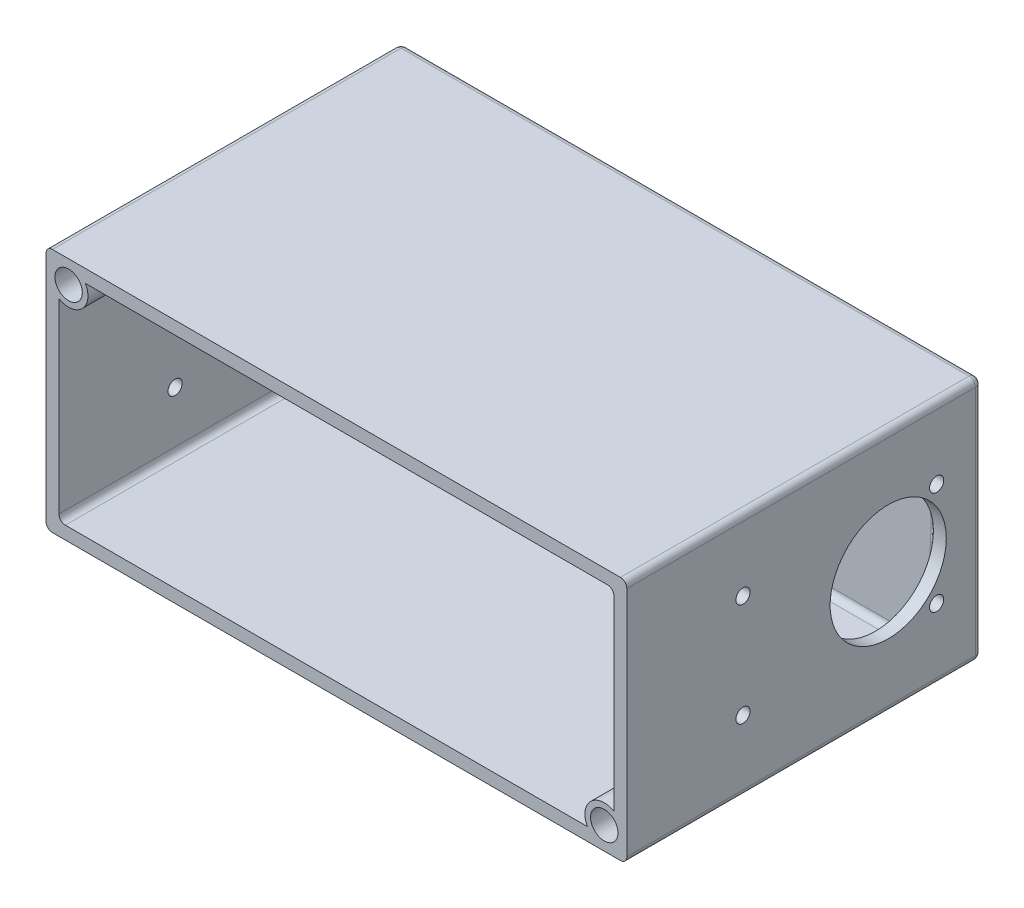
from build123d import *

# Parameters (mm, degrees)
SKIZZE1_W                       = 90
SKIZZE1_H                       = 38
AUFSATZ_LINEAR_AUSTRAGEN1_DEPTH = 5
SKIZZE2_W                       = 90
SKIZZE2_H                       = 38
SKIZZE2_W_2                     = 86
SKIZZE2_H_2                     = 34
AUFSATZ_LINEAR_AUSTRAGEN2_DEPTH = 50
SKIZZE4_R                       = 9
SCHNITT_LINEAR_AUSTRAGEN1_DEPTH = 108.172757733
SKIZZE5_R                       = 1.1
SCHNITT_LINEAR_AUSTRAGEN2_DEPTH = 108.172757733
SKIZZE7_R                       = 3
AUFSATZ_LINEAR_AUSTRAGEN3_DEPTH = 50
SKIZZE8_R                       = 2.125
SCHNITT_LINEAR_AUSTRAGEN3_DEPTH = 3.5
SKIZZE9_R                       = 0.75
SCHNITT_LINEAR_AUSTRAGEN4_DEPTH = 25
VERRUNDUNG1_R                   = 1


with BuildPart() as part:
    # Skizze1 → Aufsatz-Linear austragen1 (new body)
    with BuildSketch(Plane.XY):
        Rectangle(SKIZZE1_W, SKIZZE1_H)
    extrude(amount=AUFSATZ_LINEAR_AUSTRAGEN1_DEPTH)

    # Skizze2 → Aufsatz-Linear austragen2 (add)
    with BuildSketch(Plane.XY.offset(5)):
        Rectangle(SKIZZE2_W, SKIZZE2_H)
        Rectangle(SKIZZE2_W_2, SKIZZE2_H_2, mode=Mode.SUBTRACT)
    extrude(amount=AUFSATZ_LINEAR_AUSTRAGEN2_DEPTH)

    # Skizze4 → Schnitt-Linear austragen1 (cut, through all)
    with BuildSketch(Plane(origin=(45, 0, 0), x_dir=(0, 0, -1), z_dir=(1, 0, 0))):
        with Locations((-14.5, 0)):
            Circle(SKIZZE4_R)
    extrude(amount=-SCHNITT_LINEAR_AUSTRAGEN1_DEPTH, mode=Mode.SUBTRACT)

    # Skizze5 → Schnitt-Linear austragen2 (cut, through all)
    with BuildSketch(Plane(origin=(45, 0, 0), x_dir=(0, 0, -1), z_dir=(1, 0, 0))):
        with Locations((-37, 8)):
            Circle(SKIZZE5_R)
        with Locations((-7, 8)):
            Circle(SKIZZE5_R)
        with Locations((-7, -8)):
            Circle(SKIZZE5_R)
        with Locations((-37, -8)):
            Circle(SKIZZE5_R)
    extrude(amount=-SCHNITT_LINEAR_AUSTRAGEN2_DEPTH, mode=Mode.SUBTRACT)

    # Skizze7 → Aufsatz-Linear austragen3 (add)
    with BuildSketch(Plane.XY.offset(5)):
        with Locations((-41.5, 15.5)):
            Circle(SKIZZE7_R)
        with Locations((41.5, -15.5)):
            Circle(SKIZZE7_R)
    extrude(amount=AUFSATZ_LINEAR_AUSTRAGEN3_DEPTH)

    # Skizze8 → Schnitt-Linear austragen3 (cut)
    with BuildSketch(Plane.XY.offset(55)):
        with Locations((-41.5, 15.5)):
            Circle(SKIZZE8_R)
        with Locations((41.5, -15.5)):
            Circle(SKIZZE8_R)
    extrude(amount=-SCHNITT_LINEAR_AUSTRAGEN3_DEPTH, mode=Mode.SUBTRACT)

    # Skizze9 → Schnitt-Linear austragen4 (cut)
    with BuildSketch(Plane.XY.offset(55)):
        with Locations((-41.5, 15.5)):
            Circle(SKIZZE9_R)
        with Locations((41.5, -15.5)):
            Circle(SKIZZE9_R)
    extrude(amount=-SCHNITT_LINEAR_AUSTRAGEN4_DEPTH, mode=Mode.SUBTRACT)

    # Verrundung1
    verrundung1_edges = [part.edges().sort_by_distance(p)[0] for p in [
        (2.049038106, 17, 5),
        (-2.049038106, -17, 5),
        (43, 17, 30),
        (-43, -17, 30),
        (0, 19, 0),
        (45, 0, 0),
        (0, -19, 0),
        (-45, 0, 0),
        (-45, 19, 27.5),
        (45, 19, 27.5),
        (45, -19, 27.5),
        (-45, -19, 27.5),
        (43, 2.049038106, 5),
    ]]
    fillet(verrundung1_edges, radius=VERRUNDUNG1_R)


solid = part.part
